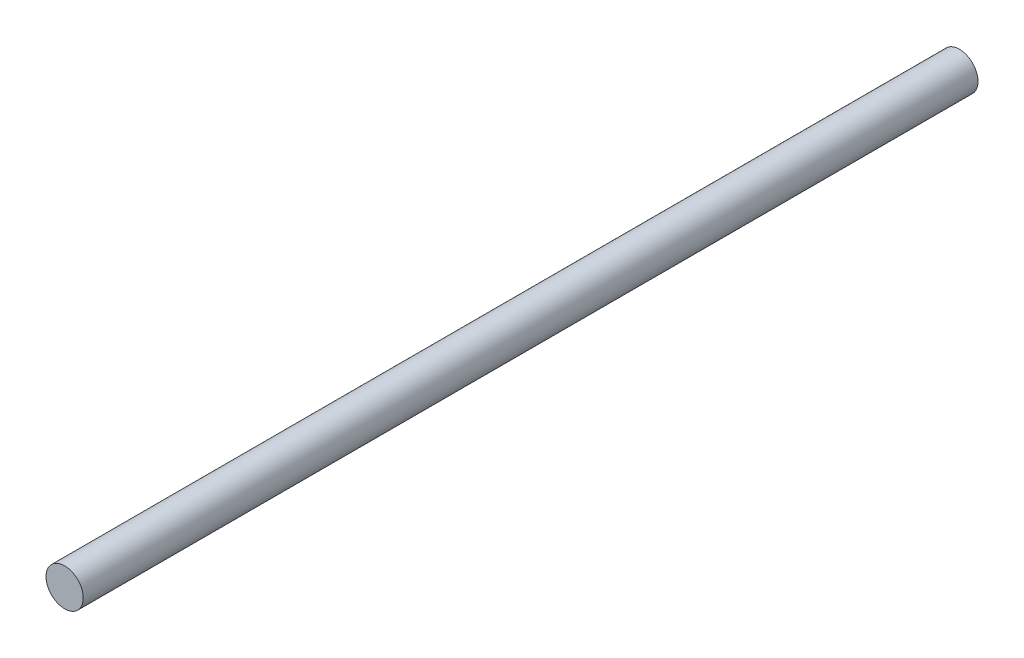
from build123d import *

# Parameters (mm, degrees)
SKETCH1_R           = 3.175
BOSS_EXTRUDE1_DEPTH = 152.4


with BuildPart() as part:
    # Sketch1 → Boss-Extrude1 (new body)
    with BuildSketch(Plane.XY):
        with Locations(Location((-56.219508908, 20.732506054, 0), (0, 0, 180))):
            Circle(SKETCH1_R)
    extrude(amount=BOSS_EXTRUDE1_DEPTH)


solid = part.part
